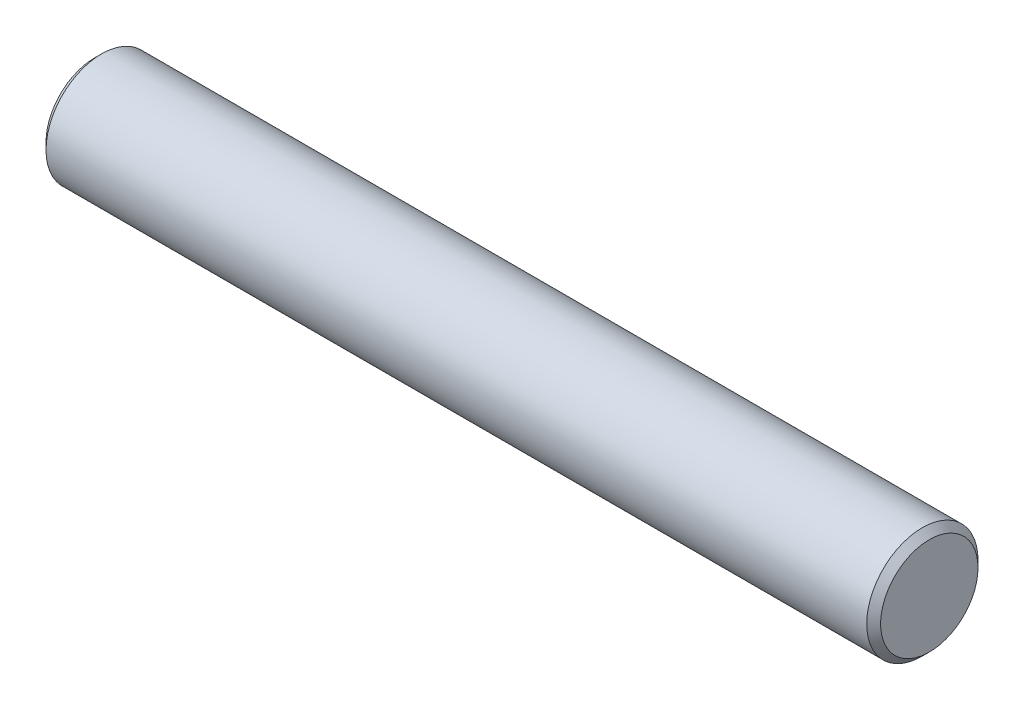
ISO-10303-21;
HEADER;
FILE_DESCRIPTION(('STEP AP214'),'2;1');
FILE_NAME('part.step','',(''),(''),'','','');
FILE_SCHEMA(('AUTOMOTIVE_DESIGN { 1 0 10303 214 1 1 1 1 }'));
ENDSEC;
DATA;
#1=APPLICATION_CONTEXT('core data for automotive mechanical design processes');
#2=APPLICATION_PROTOCOL_DEFINITION('international standard','automotive_design',2000,#1);
#3=PRODUCT_CONTEXT('',#1,'mechanical');
#4=PRODUCT('Part','Part','',(#3));
#5=PRODUCT_RELATED_PRODUCT_CATEGORY('part','',(#4));
#6=PRODUCT_DEFINITION_FORMATION('','',#4);
#7=PRODUCT_DEFINITION_CONTEXT('part definition',#1,'design');
#8=PRODUCT_DEFINITION('design','',#6,#7);
#9=PRODUCT_DEFINITION_SHAPE('','',#8);
#10=(LENGTH_UNIT() NAMED_UNIT(*) SI_UNIT(.MILLI.,.METRE.));
#11=(NAMED_UNIT(*) PLANE_ANGLE_UNIT() SI_UNIT($,.RADIAN.));
#12=(NAMED_UNIT(*) SI_UNIT($,.STERADIAN.) SOLID_ANGLE_UNIT());
#13=UNCERTAINTY_MEASURE_WITH_UNIT(LENGTH_MEASURE(1.E-05),#10,'distance_accuracy_value','');
#14=(GEOMETRIC_REPRESENTATION_CONTEXT(3) GLOBAL_UNCERTAINTY_ASSIGNED_CONTEXT((#13)) GLOBAL_UNIT_ASSIGNED_CONTEXT((#10,
#11,#12)) REPRESENTATION_CONTEXT('',''));
#15=CARTESIAN_POINT('',(0.,0.,0.));
#16=DIRECTION('',(0.,0.,1.));
#17=DIRECTION('',(1.,0.,0.));
#18=AXIS2_PLACEMENT_3D('',#15,#16,#17);
#19=CARTESIAN_POINT('',(0.,0.,0.));
#20=DIRECTION('',(-1.,0.,0.));
#21=DIRECTION('',(0.,0.,1.));
#22=AXIS2_PLACEMENT_3D('',#19,#20,#21);
#23=PLANE('',#22);
#24=CARTESIAN_POINT('',(0.,0.,0.));
#25=DIRECTION('',(-1.,0.,0.));
#26=DIRECTION('',(0.,0.,1.));
#27=AXIS2_PLACEMENT_3D('',#24,#25,#26);
#28=CIRCLE('',#27,8.74999999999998);
#29=CARTESIAN_POINT('',(0.,0.,8.74999999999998));
#30=VERTEX_POINT('',#29);
#31=EDGE_CURVE('E44',#30,#30,#28,.T.);
#32=ORIENTED_EDGE('',*,*,#31,.T.);
#33=EDGE_LOOP('',(#32));
#34=FACE_BOUND('',#33,.T.);
#35=ADVANCED_FACE('F30',(#34),#23,.T.);
#36=CARTESIAN_POINT('',(0.,0.,0.));
#37=DIRECTION('',(-1.,0.,0.));
#38=DIRECTION('',(0.,0.,1.));
#39=AXIS2_PLACEMENT_3D('',#36,#37,#38);
#40=CYLINDRICAL_SURFACE('',#39,9.99999999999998);
#41=CARTESIAN_POINT('',(1.25000000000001,0.,0.));
#42=DIRECTION('',(-1.,0.,0.));
#43=DIRECTION('',(0.,0.,1.));
#44=AXIS2_PLACEMENT_3D('',#41,#42,#43);
#45=CIRCLE('',#44,9.99999999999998);
#46=CARTESIAN_POINT('',(1.25000000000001,0.,9.99999999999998));
#47=VERTEX_POINT('',#46);
#48=EDGE_CURVE('E36',#47,#47,#45,.F.);
#49=ORIENTED_EDGE('',*,*,#48,.T.);
#50=EDGE_LOOP('',(#49));
#51=FACE_BOUND('',#50,.T.);
#52=CARTESIAN_POINT('',(148.75,0.,0.));
#53=DIRECTION('',(1.,0.,0.));
#54=DIRECTION('',(0.,0.,-1.));
#55=AXIS2_PLACEMENT_3D('',#52,#53,#54);
#56=CIRCLE('',#55,9.99999999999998);
#57=CARTESIAN_POINT('',(148.75,0.,-9.99999999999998));
#58=VERTEX_POINT('',#57);
#59=EDGE_CURVE('E40',#58,#58,#56,.F.);
#60=ORIENTED_EDGE('',*,*,#59,.T.);
#61=EDGE_LOOP('',(#60));
#62=FACE_BOUND('',#61,.T.);
#63=ADVANCED_FACE('F63',(#51,#62),#40,.T.);
#64=CARTESIAN_POINT('',(150.,9.99999999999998,0.));
#65=DIRECTION('',(1.,0.,0.));
#66=DIRECTION('',(0.,0.,-1.));
#67=AXIS2_PLACEMENT_3D('',#64,#65,#66);
#68=PLANE('',#67);
#69=CARTESIAN_POINT('',(150.,0.,0.));
#70=DIRECTION('',(1.,0.,0.));
#71=DIRECTION('',(0.,0.,-1.));
#72=AXIS2_PLACEMENT_3D('',#69,#70,#71);
#73=CIRCLE('',#72,8.74999999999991);
#74=CARTESIAN_POINT('',(150.,0.,-8.74999999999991));
#75=VERTEX_POINT('',#74);
#76=EDGE_CURVE('E10',#75,#75,#73,.T.);
#77=ORIENTED_EDGE('',*,*,#76,.T.);
#78=EDGE_LOOP('',(#77));
#79=FACE_BOUND('',#78,.T.);
#80=ADVANCED_FACE('F54',(#79),#68,.T.);
#81=CARTESIAN_POINT('',(0.,0.,0.));
#82=DIRECTION('',(1.,0.,0.));
#83=DIRECTION('',(0.,0.,-1.));
#84=AXIS2_PLACEMENT_3D('',#81,#82,#83);
#85=CONICAL_SURFACE('',#84,8.74999999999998,0.785398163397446);
#86=ORIENTED_EDGE('',*,*,#48,.F.);
#87=EDGE_LOOP('',(#86));
#88=FACE_BOUND('',#87,.T.);
#89=ORIENTED_EDGE('',*,*,#31,.F.);
#90=EDGE_LOOP('',(#89));
#91=FACE_BOUND('',#90,.T.);
#92=ADVANCED_FACE('F51',(#88,#91),#85,.T.);
#93=CARTESIAN_POINT('',(148.75,0.,0.));
#94=DIRECTION('',(-1.,0.,0.));
#95=DIRECTION('',(0.,0.,1.));
#96=AXIS2_PLACEMENT_3D('',#93,#94,#95);
#97=CONICAL_SURFACE('',#96,9.99999999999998,0.785398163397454);
#98=ORIENTED_EDGE('',*,*,#76,.F.);
#99=EDGE_LOOP('',(#98));
#100=FACE_BOUND('',#99,.T.);
#101=ORIENTED_EDGE('',*,*,#59,.F.);
#102=EDGE_LOOP('',(#101));
#103=FACE_BOUND('',#102,.T.);
#104=ADVANCED_FACE('F53',(#100,#103),#97,.T.);
#105=CLOSED_SHELL('',(#35,#63,#80,#92,#104));
#106=MANIFOLD_SOLID_BREP('B2',#105);
#107=ADVANCED_BREP_SHAPE_REPRESENTATION('',(#18,#106),#14);
#108=SHAPE_DEFINITION_REPRESENTATION(#9,#107);
ENDSEC;
END-ISO-10303-21;
